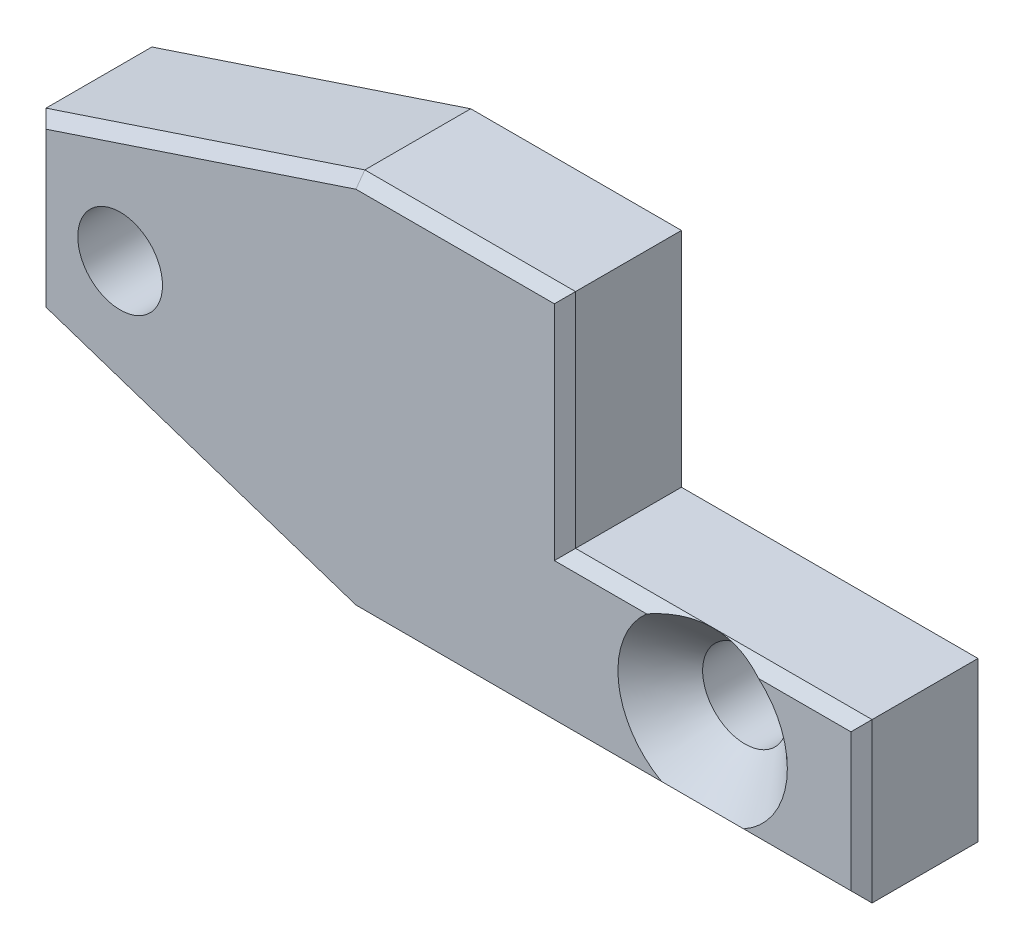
ISO-10303-21;
HEADER;
FILE_DESCRIPTION(('STEP AP214'),'2;1');
FILE_NAME('part.step','',(''),(''),'','','');
FILE_SCHEMA(('AUTOMOTIVE_DESIGN { 1 0 10303 214 1 1 1 1 }'));
ENDSEC;
DATA;
#1=APPLICATION_CONTEXT('core data for automotive mechanical design processes');
#2=APPLICATION_PROTOCOL_DEFINITION('international standard','automotive_design',2000,#1);
#3=PRODUCT_CONTEXT('',#1,'mechanical');
#4=PRODUCT('Part','Part','',(#3));
#5=PRODUCT_RELATED_PRODUCT_CATEGORY('part','',(#4));
#6=PRODUCT_DEFINITION_FORMATION('','',#4);
#7=PRODUCT_DEFINITION_CONTEXT('part definition',#1,'design');
#8=PRODUCT_DEFINITION('design','',#6,#7);
#9=PRODUCT_DEFINITION_SHAPE('','',#8);
#10=(LENGTH_UNIT() NAMED_UNIT(*) SI_UNIT(.MILLI.,.METRE.));
#11=(NAMED_UNIT(*) PLANE_ANGLE_UNIT() SI_UNIT($,.RADIAN.));
#12=(NAMED_UNIT(*) SI_UNIT($,.STERADIAN.) SOLID_ANGLE_UNIT());
#13=UNCERTAINTY_MEASURE_WITH_UNIT(LENGTH_MEASURE(1.E-05),#10,'distance_accuracy_value','');
#14=(GEOMETRIC_REPRESENTATION_CONTEXT(3) GLOBAL_UNCERTAINTY_ASSIGNED_CONTEXT((#13)) GLOBAL_UNIT_ASSIGNED_CONTEXT((#10,
#11,#12)) REPRESENTATION_CONTEXT('',''));
#15=CARTESIAN_POINT('',(0.,0.,0.));
#16=DIRECTION('',(0.,0.,1.));
#17=DIRECTION('',(1.,0.,0.));
#18=AXIS2_PLACEMENT_3D('',#15,#16,#17);
#19=CARTESIAN_POINT('',(0.,0.,5.49999999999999));
#20=DIRECTION('',(0.,-0.707106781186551,-0.707106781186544));
#21=DIRECTION('',(0.,0.707106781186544,-0.707106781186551));
#22=AXIS2_PLACEMENT_3D('',#19,#20,#21);
#23=PLANE('',#22);
#24=DIRECTION('',(-1.,0.,0.));
#25=VECTOR('',#24,1.);
#26=CARTESIAN_POINT('',(-25.,-0.500000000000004,6.));
#27=LINE('',#26,#25);
#28=CARTESIAN_POINT('',(3.8542486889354,-0.500000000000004,6.));
#29=VERTEX_POINT('',#28);
#30=CARTESIAN_POINT('',(-0.500000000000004,-0.500000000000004,6.));
#31=VERTEX_POINT('',#30);
#32=EDGE_CURVE('E263',#29,#31,#27,.T.);
#33=ORIENTED_EDGE('',*,*,#32,.F.);
#34=CARTESIAN_POINT('',(3.8542486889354,-0.500000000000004,6.));
#35=CARTESIAN_POINT('',(4.01258641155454,-0.440132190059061,5.94013219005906));
#36=CARTESIAN_POINT('',(4.17423871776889,-0.384426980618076,5.88442698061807));
#37=CARTESIAN_POINT('',(4.50389329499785,-0.282663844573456,5.78266384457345));
#38=CARTESIAN_POINT('',(4.6719083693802,-0.236626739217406,5.7366267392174));
#39=CARTESIAN_POINT('',(5.01238331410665,-0.15601328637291,5.6560132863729));
#40=CARTESIAN_POINT('',(5.18481341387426,-0.121374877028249,5.62137487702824));
#41=CARTESIAN_POINT('',(5.53361721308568,-0.0645379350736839,5.56453793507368));
#42=CARTESIAN_POINT('',(5.70998746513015,-0.0423289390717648,5.54232893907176));
#43=CARTESIAN_POINT('',(6.05237188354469,-0.0123708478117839,5.51237084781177));
#44=CARTESIAN_POINT('',(6.21822452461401,-0.00370115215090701,5.5037011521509));
#45=CARTESIAN_POINT('',(6.55036088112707,0.00178855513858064,5.49821144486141));
#46=CARTESIAN_POINT('',(6.71664467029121,-0.0013936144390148,5.50139361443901));
#47=CARTESIAN_POINT('',(7.0478905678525,-0.0194818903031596,5.51948189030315));
#48=CARTESIAN_POINT('',(7.21285285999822,-0.0343863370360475,5.53438633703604));
#49=CARTESIAN_POINT('',(7.53994163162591,-0.0753382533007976,5.57533825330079));
#50=CARTESIAN_POINT('',(7.70206865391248,-0.101383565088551,5.60138356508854));
#51=CARTESIAN_POINT('',(7.97376364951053,-0.154250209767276,5.65425020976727));
#52=CARTESIAN_POINT('',(8.0843760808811,-0.178446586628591,5.67844658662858));
#53=CARTESIAN_POINT('',(8.30341082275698,-0.231449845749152,5.73144984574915));
#54=CARTESIAN_POINT('',(8.41183240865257,-0.260258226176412,5.76025822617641));
#55=CARTESIAN_POINT('',(8.62603403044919,-0.322040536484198,5.82204053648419));
#56=CARTESIAN_POINT('',(8.73181845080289,-0.355006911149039,5.85500691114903));
#57=CARTESIAN_POINT('',(8.9407608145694,-0.424742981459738,5.92474298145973));
#58=CARTESIAN_POINT('',(9.0439205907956,-0.461509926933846,5.96150992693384));
#59=CARTESIAN_POINT('',(9.1457513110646,-0.500000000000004,6.));
#60=B_SPLINE_CURVE_WITH_KNOTS('',3,(#34,#35,#36,#37,#38,#39,#40,#41,#42,#43,#44,#45,#46,#47,#48,
#49,#50,#51,#52,#53,#54,#55,#56,#57,#58,#59),.UNSPECIFIED.,.F.,.F.,(4,2,2,2,2,2,2,2,2,2,2,2,4),
(0.,0.538753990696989,1.07865660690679,1.61556903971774,2.15202880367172,2.65011954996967,
3.14830196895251,3.64641387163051,4.144429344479,4.49158740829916,4.83885847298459,
5.18550738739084,5.53190719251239),.UNSPECIFIED.);
#61=CARTESIAN_POINT('',(6.5,0.,5.49999999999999));
#62=VERTEX_POINT('',#61);
#63=EDGE_CURVE('E11',#29,#62,#60,.T.);
#64=ORIENTED_EDGE('',*,*,#63,.T.);
#65=DIRECTION('',(1.,0.,0.));
#66=VECTOR('',#65,1.);
#67=CARTESIAN_POINT('',(0.,0.,5.49999999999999));
#68=LINE('',#67,#66);
#69=CARTESIAN_POINT('',(0.,0.,5.49999999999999));
#70=VERTEX_POINT('',#69);
#71=EDGE_CURVE('E236',#70,#62,#68,.T.);
#72=ORIENTED_EDGE('',*,*,#71,.F.);
#73=DIRECTION('',(-0.577350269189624,-0.577350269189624,0.57735026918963));
#74=VECTOR('',#73,1.);
#75=CARTESIAN_POINT('',(3.49999999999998,3.49999999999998,1.99999999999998));
#76=LINE('',#75,#74);
#77=EDGE_CURVE('E333',#31,#70,#76,.F.);
#78=ORIENTED_EDGE('',*,*,#77,.F.);
#79=EDGE_LOOP('',(#33,#64,#72,#78));
#80=FACE_BOUND('',#79,.T.);
#81=ADVANCED_FACE('F29',(#80),#23,.F.);
#82=CARTESIAN_POINT('',(-25.,10.5,6.));
#83=DIRECTION('',(0.,0.,1.));
#84=DIRECTION('',(1.,0.,0.));
#85=AXIS2_PLACEMENT_3D('',#82,#83,#84);
#86=PLANE('',#85);
#87=CARTESIAN_POINT('',(13.5,-0.500000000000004,6.));
#88=VERTEX_POINT('',#87);
#89=CARTESIAN_POINT('',(9.1457513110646,-0.500000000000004,6.));
#90=VERTEX_POINT('',#89);
#91=EDGE_CURVE('E264',#88,#90,#27,.T.);
#92=ORIENTED_EDGE('',*,*,#91,.T.);
#93=CARTESIAN_POINT('',(6.5,-3.50000000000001,6.));
#94=DIRECTION('',(0.,0.,1.));
#95=DIRECTION('',(1.,0.,0.));
#96=AXIS2_PLACEMENT_3D('',#93,#94,#95);
#97=CIRCLE('',#96,4.00000000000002);
#98=CARTESIAN_POINT('',(8.43649167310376,-7.,6.));
#99=VERTEX_POINT('',#98);
#100=EDGE_CURVE('E275',#90,#99,#97,.F.);
#101=ORIENTED_EDGE('',*,*,#100,.T.);
#102=DIRECTION('',(1.,0.,0.));
#103=VECTOR('',#102,1.);
#104=CARTESIAN_POINT('',(14.,-6.99999999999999,6.));
#105=LINE('',#104,#103);
#106=CARTESIAN_POINT('',(13.5,-6.99999999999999,6.));
#107=VERTEX_POINT('',#106);
#108=EDGE_CURVE('E257',#99,#107,#105,.T.);
#109=ORIENTED_EDGE('',*,*,#108,.T.);
#110=DIRECTION('',(0.,1.,0.));
#111=VECTOR('',#110,1.);
#112=CARTESIAN_POINT('',(13.5,10.5,6.));
#113=LINE('',#112,#111);
#114=EDGE_CURVE('E261',#107,#88,#113,.T.);
#115=ORIENTED_EDGE('',*,*,#114,.T.);
#116=EDGE_LOOP('',(#92,#101,#109,#115));
#117=FACE_BOUND('',#116,.T.);
#118=ADVANCED_FACE('F324',(#117),#86,.T.);
#119=CARTESIAN_POINT('',(0.,10.5,6.));
#120=DIRECTION('',(0.,-1.,0.));
#121=DIRECTION('',(0.,0.,-1.));
#122=AXIS2_PLACEMENT_3D('',#119,#120,#121);
#123=PLANE('',#122);
#124=DIRECTION('',(0.,0.,-1.));
#125=VECTOR('',#124,1.);
#126=CARTESIAN_POINT('',(0.,10.5,6.));
#127=LINE('',#126,#125);
#128=CARTESIAN_POINT('',(0.,10.5,5.5));
#129=VERTEX_POINT('',#128);
#130=CARTESIAN_POINT('',(0.,10.5,0.500000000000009));
#131=VERTEX_POINT('',#130);
#132=EDGE_CURVE('E380',#129,#131,#127,.T.);
#133=ORIENTED_EDGE('',*,*,#132,.T.);
#134=DIRECTION('',(-1.,0.,0.));
#135=VECTOR('',#134,1.);
#136=CARTESIAN_POINT('',(0.,10.5,0.500000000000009));
#137=LINE('',#136,#135);
#138=CARTESIAN_POINT('',(-9.94877148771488,10.5,0.500000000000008));
#139=VERTEX_POINT('',#138);
#140=EDGE_CURVE('E248',#131,#139,#137,.T.);
#141=ORIENTED_EDGE('',*,*,#140,.T.);
#142=DIRECTION('',(0.,0.,-1.));
#143=VECTOR('',#142,1.);
#144=CARTESIAN_POINT('',(-9.94877148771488,10.5,6.));
#145=LINE('',#144,#143);
#146=CARTESIAN_POINT('',(-9.94877148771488,10.5,5.5));
#147=VERTEX_POINT('',#146);
#148=EDGE_CURVE('E185',#147,#139,#145,.T.);
#149=ORIENTED_EDGE('',*,*,#148,.F.);
#150=DIRECTION('',(1.,0.,0.));
#151=VECTOR('',#150,1.);
#152=CARTESIAN_POINT('',(0.,10.5,5.5));
#153=LINE('',#152,#151);
#154=EDGE_CURVE('E246',#147,#129,#153,.T.);
#155=ORIENTED_EDGE('',*,*,#154,.T.);
#156=EDGE_LOOP('',(#133,#141,#149,#155));
#157=FACE_BOUND('',#156,.T.);
#158=ADVANCED_FACE('F328',(#157),#123,.F.);
#159=CARTESIAN_POINT('',(-9.94877148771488,10.5,6.));
#160=DIRECTION('',(0.315258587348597,-0.949005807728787,0.));
#161=DIRECTION('',(0.949005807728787,0.315258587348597,0.));
#162=AXIS2_PLACEMENT_3D('',#159,#160,#161);
#163=PLANE('',#162);
#164=ORIENTED_EDGE('',*,*,#148,.T.);
#165=DIRECTION('',(-0.949005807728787,-0.315258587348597,0.));
#166=VECTOR('',#165,1.);
#167=CARTESIAN_POINT('',(-9.94877148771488,10.5,0.500000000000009));
#168=LINE('',#167,#166);
#169=CARTESIAN_POINT('',(-25.,5.5,0.500000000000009));
#170=VERTEX_POINT('',#169);
#171=EDGE_CURVE('E184',#139,#170,#168,.T.);
#172=ORIENTED_EDGE('',*,*,#171,.T.);
#173=DIRECTION('',(0.,0.,-1.));
#174=VECTOR('',#173,1.);
#175=CARTESIAN_POINT('',(-25.,5.5,6.));
#176=LINE('',#175,#174);
#177=CARTESIAN_POINT('',(-25.,5.5,5.5));
#178=VERTEX_POINT('',#177);
#179=EDGE_CURVE('E167',#178,#170,#176,.T.);
#180=ORIENTED_EDGE('',*,*,#179,.F.);
#181=DIRECTION('',(0.949005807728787,0.315258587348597,0.));
#182=VECTOR('',#181,1.);
#183=CARTESIAN_POINT('',(-9.94877148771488,10.5,5.5));
#184=LINE('',#183,#182);
#185=EDGE_CURVE('E181',#178,#147,#184,.T.);
#186=ORIENTED_EDGE('',*,*,#185,.T.);
#187=EDGE_LOOP('',(#164,#172,#180,#186));
#188=FACE_BOUND('',#187,.T.);
#189=ADVANCED_FACE('F31',(#188),#163,.F.);
#190=CARTESIAN_POINT('',(-25.,5.5,6.));
#191=DIRECTION('',(1.,0.,0.));
#192=DIRECTION('',(0.,0.,-1.));
#193=AXIS2_PLACEMENT_3D('',#190,#191,#192);
#194=PLANE('',#193);
#195=ORIENTED_EDGE('',*,*,#179,.T.);
#196=DIRECTION('',(0.,-1.,0.));
#197=VECTOR('',#196,1.);
#198=CARTESIAN_POINT('',(-25.,5.5,0.500000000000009));
#199=LINE('',#198,#197);
#200=CARTESIAN_POINT('',(-25.,-2.5,0.500000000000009));
#201=VERTEX_POINT('',#200);
#202=EDGE_CURVE('E174',#170,#201,#199,.T.);
#203=ORIENTED_EDGE('',*,*,#202,.T.);
#204=DIRECTION('',(0.,0.,-1.));
#205=VECTOR('',#204,1.);
#206=CARTESIAN_POINT('',(-25.,-2.5,6.));
#207=LINE('',#206,#205);
#208=CARTESIAN_POINT('',(-25.,-2.5,5.5));
#209=VERTEX_POINT('',#208);
#210=EDGE_CURVE('E169',#209,#201,#207,.T.);
#211=ORIENTED_EDGE('',*,*,#210,.F.);
#212=DIRECTION('',(0.,1.,0.));
#213=VECTOR('',#212,1.);
#214=CARTESIAN_POINT('',(-25.,5.5,5.5));
#215=LINE('',#214,#213);
#216=EDGE_CURVE('E164',#209,#178,#215,.T.);
#217=ORIENTED_EDGE('',*,*,#216,.T.);
#218=EDGE_LOOP('',(#195,#203,#211,#217));
#219=FACE_BOUND('',#218,.T.);
#220=ADVANCED_FACE('F166',(#219),#194,.F.);
#221=CARTESIAN_POINT('',(-25.,-2.5,6.));
#222=DIRECTION('',(0.315258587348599,0.949005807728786,0.));
#223=DIRECTION('',(-0.949005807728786,0.315258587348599,0.));
#224=AXIS2_PLACEMENT_3D('',#221,#222,#223);
#225=PLANE('',#224);
#226=ORIENTED_EDGE('',*,*,#210,.T.);
#227=DIRECTION('',(0.949005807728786,-0.315258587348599,0.));
#228=VECTOR('',#227,1.);
#229=CARTESIAN_POINT('',(-25.,-2.5,0.500000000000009));
#230=LINE('',#229,#228);
#231=CARTESIAN_POINT('',(-9.94877148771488,-7.50000000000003,0.500000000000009));
#232=VERTEX_POINT('',#231);
#233=EDGE_CURVE('E225',#201,#232,#230,.T.);
#234=ORIENTED_EDGE('',*,*,#233,.T.);
#235=DIRECTION('',(0.,0.,-1.));
#236=VECTOR('',#235,1.);
#237=CARTESIAN_POINT('',(-9.94877148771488,-7.50000000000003,6.));
#238=LINE('',#237,#236);
#239=CARTESIAN_POINT('',(-9.94877148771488,-7.50000000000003,5.5));
#240=VERTEX_POINT('',#239);
#241=EDGE_CURVE('E392',#240,#232,#238,.T.);
#242=ORIENTED_EDGE('',*,*,#241,.F.);
#243=DIRECTION('',(-0.949005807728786,0.315258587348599,0.));
#244=VECTOR('',#243,1.);
#245=CARTESIAN_POINT('',(-25.,-2.5,5.5));
#246=LINE('',#245,#244);
#247=EDGE_CURVE('E223',#240,#209,#246,.T.);
#248=ORIENTED_EDGE('',*,*,#247,.T.);
#249=EDGE_LOOP('',(#226,#234,#242,#248));
#250=FACE_BOUND('',#249,.T.);
#251=ADVANCED_FACE('F397',(#250),#225,.F.);
#252=CARTESIAN_POINT('',(-9.94877148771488,-7.50000000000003,6.));
#253=DIRECTION('',(0.,1.,0.));
#254=DIRECTION('',(-1.,0.,0.));
#255=AXIS2_PLACEMENT_3D('',#252,#253,#254);
#256=PLANE('',#255);
#257=ORIENTED_EDGE('',*,*,#241,.T.);
#258=DIRECTION('',(1.,0.,0.));
#259=VECTOR('',#258,1.);
#260=CARTESIAN_POINT('',(-9.94877148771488,-7.50000000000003,0.500000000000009));
#261=LINE('',#260,#259);
#262=CARTESIAN_POINT('',(14.,-7.5,0.500000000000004));
#263=VERTEX_POINT('',#262);
#264=EDGE_CURVE('E229',#232,#263,#261,.T.);
#265=ORIENTED_EDGE('',*,*,#264,.T.);
#266=DIRECTION('',(0.,0.,-1.));
#267=VECTOR('',#266,1.);
#268=CARTESIAN_POINT('',(14.,-7.5,6.));
#269=LINE('',#268,#267);
#270=CARTESIAN_POINT('',(14.,-7.5,5.5));
#271=VERTEX_POINT('',#270);
#272=EDGE_CURVE('E389',#271,#263,#269,.T.);
#273=ORIENTED_EDGE('',*,*,#272,.F.);
#274=DIRECTION('',(-1.,0.,0.));
#275=VECTOR('',#274,1.);
#276=CARTESIAN_POINT('',(-9.94877148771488,-7.50000000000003,5.5));
#277=LINE('',#276,#275);
#278=EDGE_CURVE('E227',#271,#240,#277,.T.);
#279=ORIENTED_EDGE('',*,*,#278,.T.);
#280=EDGE_LOOP('',(#257,#265,#273,#279));
#281=FACE_BOUND('',#280,.T.);
#282=ADVANCED_FACE('F442',(#281),#256,.F.);
#283=CARTESIAN_POINT('',(14.,0.,6.));
#284=DIRECTION('',(1.,0.,0.));
#285=DIRECTION('',(0.,1.,0.));
#286=AXIS2_PLACEMENT_3D('',#283,#284,#285);
#287=PLANE('',#286);
#288=ORIENTED_EDGE('',*,*,#272,.T.);
#289=DIRECTION('',(0.,1.,0.));
#290=VECTOR('',#289,1.);
#291=CARTESIAN_POINT('',(14.,0.,0.500000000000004));
#292=LINE('',#291,#290);
#293=CARTESIAN_POINT('',(14.,0.,0.500000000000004));
#294=VERTEX_POINT('',#293);
#295=EDGE_CURVE('E233',#263,#294,#292,.T.);
#296=ORIENTED_EDGE('',*,*,#295,.T.);
#297=DIRECTION('',(0.,0.,-1.));
#298=VECTOR('',#297,1.);
#299=CARTESIAN_POINT('',(14.,0.,6.));
#300=LINE('',#299,#298);
#301=CARTESIAN_POINT('',(14.,0.,5.49999999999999));
#302=VERTEX_POINT('',#301);
#303=EDGE_CURVE('E386',#302,#294,#300,.T.);
#304=ORIENTED_EDGE('',*,*,#303,.F.);
#305=DIRECTION('',(0.,-1.,0.));
#306=VECTOR('',#305,1.);
#307=CARTESIAN_POINT('',(14.,0.,5.49999999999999));
#308=LINE('',#307,#306);
#309=EDGE_CURVE('E231',#302,#271,#308,.T.);
#310=ORIENTED_EDGE('',*,*,#309,.T.);
#311=EDGE_LOOP('',(#288,#296,#304,#310));
#312=FACE_BOUND('',#311,.T.);
#313=ADVANCED_FACE('F445',(#312),#287,.T.);
#314=CARTESIAN_POINT('',(0.,0.,6.));
#315=DIRECTION('',(0.,1.,0.));
#316=DIRECTION('',(0.,0.,1.));
#317=AXIS2_PLACEMENT_3D('',#314,#315,#316);
#318=PLANE('',#317);
#319=ORIENTED_EDGE('',*,*,#303,.T.);
#320=DIRECTION('',(-1.,0.,0.));
#321=VECTOR('',#320,1.);
#322=CARTESIAN_POINT('',(0.,0.,0.500000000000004));
#323=LINE('',#322,#321);
#324=CARTESIAN_POINT('',(0.,0.,0.500000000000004));
#325=VERTEX_POINT('',#324);
#326=EDGE_CURVE('E239',#294,#325,#323,.T.);
#327=ORIENTED_EDGE('',*,*,#326,.T.);
#328=DIRECTION('',(0.,0.,-1.));
#329=VECTOR('',#328,1.);
#330=CARTESIAN_POINT('',(0.,0.,6.));
#331=LINE('',#330,#329);
#332=EDGE_CURVE('E383',#70,#325,#331,.T.);
#333=ORIENTED_EDGE('',*,*,#332,.F.);
#334=ORIENTED_EDGE('',*,*,#71,.T.);
#335=EDGE_CURVE('E235',#62,#302,#68,.T.);
#336=ORIENTED_EDGE('',*,*,#335,.T.);
#337=EDGE_LOOP('',(#319,#327,#333,#334,#336));
#338=FACE_BOUND('',#337,.T.);
#339=ADVANCED_FACE('F448',(#338),#318,.T.);
#340=CARTESIAN_POINT('',(0.,10.5,6.));
#341=DIRECTION('',(1.,0.,0.));
#342=DIRECTION('',(0.,1.,0.));
#343=AXIS2_PLACEMENT_3D('',#340,#341,#342);
#344=PLANE('',#343);
#345=ORIENTED_EDGE('',*,*,#332,.T.);
#346=DIRECTION('',(0.,1.,0.));
#347=VECTOR('',#346,1.);
#348=CARTESIAN_POINT('',(0.,10.5,0.500000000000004));
#349=LINE('',#348,#347);
#350=EDGE_CURVE('E244',#325,#131,#349,.T.);
#351=ORIENTED_EDGE('',*,*,#350,.T.);
#352=ORIENTED_EDGE('',*,*,#132,.F.);
#353=DIRECTION('',(0.,-1.,0.));
#354=VECTOR('',#353,1.);
#355=CARTESIAN_POINT('',(0.,10.5,5.49999999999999));
#356=LINE('',#355,#354);
#357=EDGE_CURVE('E241',#129,#70,#356,.T.);
#358=ORIENTED_EDGE('',*,*,#357,.T.);
#359=EDGE_LOOP('',(#345,#351,#352,#358));
#360=FACE_BOUND('',#359,.T.);
#361=ADVANCED_FACE('F453',(#360),#344,.T.);
#362=CARTESIAN_POINT('',(-21.,1.49999999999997,6.));
#363=DIRECTION('',(0.,0.,1.));
#364=DIRECTION('',(1.,0.,0.));
#365=AXIS2_PLACEMENT_3D('',#362,#363,#364);
#366=CIRCLE('',#365,2.);
#367=CARTESIAN_POINT('',(-19.,1.49999999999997,6.));
#368=VERTEX_POINT('',#367);
#369=EDGE_CURVE('E458',#368,#368,#366,.T.);
#370=ORIENTED_EDGE('',*,*,#369,.F.);
#371=EDGE_LOOP('',(#370));
#372=FACE_BOUND('',#371,.T.);
#373=CARTESIAN_POINT('',(-9.86789471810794,-7.00000000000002,6.));
#374=VERTEX_POINT('',#373);
#375=CARTESIAN_POINT('',(4.56350832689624,-7.,6.));
#376=VERTEX_POINT('',#375);
#377=EDGE_CURVE('E258',#374,#376,#105,.T.);
#378=ORIENTED_EDGE('',*,*,#377,.T.);
#379=CARTESIAN_POINT('',(6.5,-3.50000000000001,6.));
#380=DIRECTION('',(0.,0.,1.));
#381=DIRECTION('',(1.,0.,0.));
#382=AXIS2_PLACEMENT_3D('',#379,#380,#381);
#383=CIRCLE('',#382,4.00000000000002);
#384=EDGE_CURVE('E273',#376,#29,#383,.F.);
#385=ORIENTED_EDGE('',*,*,#384,.T.);
#386=ORIENTED_EDGE('',*,*,#32,.T.);
#387=DIRECTION('',(0.,1.,0.));
#388=VECTOR('',#387,1.);
#389=CARTESIAN_POINT('',(-0.500000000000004,10.5,6.));
#390=LINE('',#389,#388);
#391=CARTESIAN_POINT('',(-0.500000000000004,9.99999999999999,6.));
#392=VERTEX_POINT('',#391);
#393=EDGE_CURVE('E267',#31,#392,#390,.T.);
#394=ORIENTED_EDGE('',*,*,#393,.T.);
#395=DIRECTION('',(-1.,0.,0.));
#396=VECTOR('',#395,1.);
#397=CARTESIAN_POINT('',(-9.94877148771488,9.99999999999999,6.));
#398=LINE('',#397,#396);
#399=CARTESIAN_POINT('',(-9.86789471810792,9.99999999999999,6.));
#400=VERTEX_POINT('',#399);
#401=EDGE_CURVE('E250',#392,#400,#398,.T.);
#402=ORIENTED_EDGE('',*,*,#401,.T.);
#403=DIRECTION('',(-0.949005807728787,-0.315258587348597,0.));
#404=VECTOR('',#403,1.);
#405=CARTESIAN_POINT('',(-24.8423707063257,5.0254970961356,6.));
#406=LINE('',#405,#404);
#407=CARTESIAN_POINT('',(-24.5,5.13923223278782,6.));
#408=VERTEX_POINT('',#407);
#409=EDGE_CURVE('E252',#400,#408,#406,.T.);
#410=ORIENTED_EDGE('',*,*,#409,.T.);
#411=DIRECTION('',(0.,-1.,0.));
#412=VECTOR('',#411,1.);
#413=CARTESIAN_POINT('',(-24.5,-2.5,6.));
#414=LINE('',#413,#412);
#415=CARTESIAN_POINT('',(-24.5,-2.13923223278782,6.));
#416=VERTEX_POINT('',#415);
#417=EDGE_CURVE('E191',#408,#416,#414,.T.);
#418=ORIENTED_EDGE('',*,*,#417,.T.);
#419=DIRECTION('',(0.949005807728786,-0.315258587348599,0.));
#420=VECTOR('',#419,1.);
#421=CARTESIAN_POINT('',(-9.79114219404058,-7.02549709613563,6.));
#422=LINE('',#421,#420);
#423=EDGE_CURVE('E255',#416,#374,#422,.T.);
#424=ORIENTED_EDGE('',*,*,#423,.T.);
#425=EDGE_LOOP('',(#378,#385,#386,#394,#402,#410,#418,#424));
#426=FACE_BOUND('',#425,.T.);
#427=ADVANCED_FACE('F331',(#372,#426),#86,.T.);
#428=CARTESIAN_POINT('',(-25.,10.5,0.));
#429=DIRECTION('',(0.,0.,1.));
#430=DIRECTION('',(1.,0.,0.));
#431=AXIS2_PLACEMENT_3D('',#428,#429,#430);
#432=PLANE('',#431);
#433=CARTESIAN_POINT('',(6.5,-3.50000000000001,0.));
#434=DIRECTION('',(0.,0.,1.));
#435=DIRECTION('',(1.,0.,0.));
#436=AXIS2_PLACEMENT_3D('',#433,#434,#435);
#437=CIRCLE('',#436,2.);
#438=CARTESIAN_POINT('',(8.5,-3.50000000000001,0.));
#439=VERTEX_POINT('',#438);
#440=EDGE_CURVE('E463',#439,#439,#437,.T.);
#441=ORIENTED_EDGE('',*,*,#440,.T.);
#442=EDGE_LOOP('',(#441));
#443=FACE_BOUND('',#442,.T.);
#444=CARTESIAN_POINT('',(-21.,1.49999999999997,0.));
#445=DIRECTION('',(0.,0.,1.));
#446=DIRECTION('',(1.,0.,0.));
#447=AXIS2_PLACEMENT_3D('',#444,#445,#446);
#448=CIRCLE('',#447,2.);
#449=CARTESIAN_POINT('',(-19.,1.49999999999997,0.));
#450=VERTEX_POINT('',#449);
#451=EDGE_CURVE('E456',#450,#450,#448,.T.);
#452=ORIENTED_EDGE('',*,*,#451,.T.);
#453=EDGE_LOOP('',(#452));
#454=FACE_BOUND('',#453,.T.);
#455=DIRECTION('',(0.,1.,0.));
#456=VECTOR('',#455,1.);
#457=CARTESIAN_POINT('',(-24.5,10.5,0.));
#458=LINE('',#457,#456);
#459=CARTESIAN_POINT('',(-24.5,-2.13923223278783,0.));
#460=VERTEX_POINT('',#459);
#461=CARTESIAN_POINT('',(-24.5,5.13923223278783,0.));
#462=VERTEX_POINT('',#461);
#463=EDGE_CURVE('E218',#460,#462,#458,.T.);
#464=ORIENTED_EDGE('',*,*,#463,.T.);
#465=DIRECTION('',(0.949005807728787,0.315258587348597,0.));
#466=VECTOR('',#465,1.);
#467=CARTESIAN_POINT('',(-23.3464595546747,5.52243698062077,0.));
#468=LINE('',#467,#466);
#469=CARTESIAN_POINT('',(-9.86789471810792,10.,0.));
#470=VERTEX_POINT('',#469);
#471=EDGE_CURVE('E175',#462,#470,#468,.T.);
#472=ORIENTED_EDGE('',*,*,#471,.T.);
#473=DIRECTION('',(1.,0.,0.));
#474=VECTOR('',#473,1.);
#475=CARTESIAN_POINT('',(-25.,10.,0.));
#476=LINE('',#475,#474);
#477=CARTESIAN_POINT('',(-0.500000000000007,10.,0.));
#478=VERTEX_POINT('',#477);
#479=EDGE_CURVE('E203',#470,#478,#476,.T.);
#480=ORIENTED_EDGE('',*,*,#479,.T.);
#481=DIRECTION('',(0.,-1.,0.));
#482=VECTOR('',#481,1.);
#483=CARTESIAN_POINT('',(-0.500000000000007,0.,0.));
#484=LINE('',#483,#482);
#485=CARTESIAN_POINT('',(-0.500000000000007,-0.500000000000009,0.));
#486=VERTEX_POINT('',#485);
#487=EDGE_CURVE('E208',#478,#486,#484,.T.);
#488=ORIENTED_EDGE('',*,*,#487,.T.);
#489=DIRECTION('',(1.,0.,0.));
#490=VECTOR('',#489,1.);
#491=CARTESIAN_POINT('',(14.,-0.500000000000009,0.));
#492=LINE('',#491,#490);
#493=CARTESIAN_POINT('',(13.5,-0.500000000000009,0.));
#494=VERTEX_POINT('',#493);
#495=EDGE_CURVE('E210',#486,#494,#492,.T.);
#496=ORIENTED_EDGE('',*,*,#495,.T.);
#497=DIRECTION('',(0.,-1.,0.));
#498=VECTOR('',#497,1.);
#499=CARTESIAN_POINT('',(13.5,-7.5,0.));
#500=LINE('',#499,#498);
#501=CARTESIAN_POINT('',(13.5,-7.,0.));
#502=VERTEX_POINT('',#501);
#503=EDGE_CURVE('E212',#494,#502,#500,.T.);
#504=ORIENTED_EDGE('',*,*,#503,.T.);
#505=DIRECTION('',(-1.,0.,0.));
#506=VECTOR('',#505,1.);
#507=CARTESIAN_POINT('',(-25.,-7.00000000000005,0.));
#508=LINE('',#507,#506);
#509=CARTESIAN_POINT('',(-9.86789471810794,-7.00000000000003,0.));
#510=VERTEX_POINT('',#509);
#511=EDGE_CURVE('E214',#502,#510,#508,.T.);
#512=ORIENTED_EDGE('',*,*,#511,.T.);
#513=DIRECTION('',(-0.949005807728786,0.315258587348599,0.));
#514=VECTOR('',#513,1.);
#515=CARTESIAN_POINT('',(-28.7317397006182,-0.733453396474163,0.));
#516=LINE('',#515,#514);
#517=EDGE_CURVE('E216',#510,#460,#516,.T.);
#518=ORIENTED_EDGE('',*,*,#517,.T.);
#519=EDGE_LOOP('',(#464,#472,#480,#488,#496,#504,#512,#518));
#520=FACE_BOUND('',#519,.T.);
#521=ADVANCED_FACE('F412',(#443,#454,#520),#432,.F.);
#522=CARTESIAN_POINT('',(13.5,10.5,0.));
#523=DIRECTION('',(0.707106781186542,0.,-0.707106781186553));
#524=DIRECTION('',(-0.707106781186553,0.,-0.707106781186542));
#525=AXIS2_PLACEMENT_3D('',#522,#523,#524);
#526=PLANE('',#525);
#527=DIRECTION('',(0.577350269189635,-0.577350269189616,0.577350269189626));
#528=VECTOR('',#527,1.);
#529=CARTESIAN_POINT('',(7.66666666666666,-1.16666666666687,-5.83333333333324));
#530=LINE('',#529,#528);
#531=EDGE_CURVE('E374',#502,#263,#530,.T.);
#532=ORIENTED_EDGE('',*,*,#531,.F.);
#533=ORIENTED_EDGE('',*,*,#503,.F.);
#534=DIRECTION('',(-0.57735026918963,-0.577350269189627,-0.577350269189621));
#535=VECTOR('',#534,1.);
#536=CARTESIAN_POINT('',(0.666666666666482,-13.3333333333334,-12.8333333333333));
#537=LINE('',#536,#535);
#538=EDGE_CURVE('E377',#294,#494,#537,.T.);
#539=ORIENTED_EDGE('',*,*,#538,.F.);
#540=ORIENTED_EDGE('',*,*,#295,.F.);
#541=EDGE_LOOP('',(#532,#533,#539,#540));
#542=FACE_BOUND('',#541,.T.);
#543=ADVANCED_FACE('F434',(#542),#526,.T.);
#544=CARTESIAN_POINT('',(-25.,-0.500000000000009,0.));
#545=DIRECTION('',(0.,0.707106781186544,-0.707106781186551));
#546=DIRECTION('',(0.,0.707106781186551,0.707106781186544));
#547=AXIS2_PLACEMENT_3D('',#544,#545,#546);
#548=PLANE('',#547);
#549=ORIENTED_EDGE('',*,*,#538,.T.);
#550=ORIENTED_EDGE('',*,*,#495,.F.);
#551=DIRECTION('',(-0.577350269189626,-0.577350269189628,-0.577350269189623));
#552=VECTOR('',#551,1.);
#553=CARTESIAN_POINT('',(-8.66666666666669,-8.66666666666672,-8.16666666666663));
#554=LINE('',#553,#552);
#555=EDGE_CURVE('E371',#325,#486,#554,.T.);
#556=ORIENTED_EDGE('',*,*,#555,.F.);
#557=ORIENTED_EDGE('',*,*,#326,.F.);
#558=EDGE_LOOP('',(#549,#550,#556,#557));
#559=FACE_BOUND('',#558,.T.);
#560=ADVANCED_FACE('F429',(#559),#548,.T.);
#561=CARTESIAN_POINT('',(-9.94877148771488,-7.50000000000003,0.500000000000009));
#562=DIRECTION('',(0.,0.707106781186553,0.707106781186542));
#563=DIRECTION('',(0.,-0.707106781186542,0.707106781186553));
#564=AXIS2_PLACEMENT_3D('',#561,#562,#563);
#565=PLANE('',#564);
#566=ORIENTED_EDGE('',*,*,#531,.T.);
#567=ORIENTED_EDGE('',*,*,#264,.F.);
#568=DIRECTION('',(0.113636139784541,0.702526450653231,-0.702526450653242));
#569=VECTOR('',#568,1.);
#570=CARTESIAN_POINT('',(-9.94877148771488,-7.50000000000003,0.500000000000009));
#571=LINE('',#570,#569);
#572=EDGE_CURVE('E368',#510,#232,#571,.F.);
#573=ORIENTED_EDGE('',*,*,#572,.F.);
#574=ORIENTED_EDGE('',*,*,#511,.F.);
#575=EDGE_LOOP('',(#566,#567,#573,#574));
#576=FACE_BOUND('',#575,.T.);
#577=ADVANCED_FACE('F439',(#576),#565,.F.);
#578=CARTESIAN_POINT('',(-0.500000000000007,10.5,0.));
#579=DIRECTION('',(0.707106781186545,0.,-0.70710678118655));
#580=DIRECTION('',(-0.70710678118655,0.,-0.707106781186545));
#581=AXIS2_PLACEMENT_3D('',#578,#579,#580);
#582=PLANE('',#581);
#583=ORIENTED_EDGE('',*,*,#555,.T.);
#584=ORIENTED_EDGE('',*,*,#487,.F.);
#585=DIRECTION('',(0.57735026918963,0.57735026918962,0.577350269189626));
#586=VECTOR('',#585,1.);
#587=CARTESIAN_POINT('',(0.,10.5,0.500000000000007));
#588=LINE('',#587,#586);
#589=EDGE_CURVE('E365',#131,#478,#588,.F.);
#590=ORIENTED_EDGE('',*,*,#589,.F.);
#591=ORIENTED_EDGE('',*,*,#350,.F.);
#592=EDGE_LOOP('',(#583,#584,#590,#591));
#593=FACE_BOUND('',#592,.T.);
#594=ADVANCED_FACE('F424',(#593),#582,.T.);
#595=CARTESIAN_POINT('',(-25.,-2.5,0.500000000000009));
#596=DIRECTION('',(0.222921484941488,0.671048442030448,0.707106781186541));
#597=DIRECTION('',(0.,-0.725359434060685,0.688370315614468));
#598=AXIS2_PLACEMENT_3D('',#595,#596,#597);
#599=PLANE('',#598);
#600=ORIENTED_EDGE('',*,*,#572,.T.);
#601=ORIENTED_EDGE('',*,*,#233,.F.);
#602=DIRECTION('',(0.629864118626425,0.454469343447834,-0.629864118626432));
#603=VECTOR('',#602,1.);
#604=CARTESIAN_POINT('',(-25.,-2.5,0.500000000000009));
#605=LINE('',#604,#603);
#606=EDGE_CURVE('E362',#460,#201,#605,.F.);
#607=ORIENTED_EDGE('',*,*,#606,.F.);
#608=ORIENTED_EDGE('',*,*,#517,.F.);
#609=EDGE_LOOP('',(#600,#601,#607,#608));
#610=FACE_BOUND('',#609,.T.);
#611=ADVANCED_FACE('F402',(#610),#599,.F.);
#612=CARTESIAN_POINT('',(0.,10.5,0.500000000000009));
#613=DIRECTION('',(0.,-0.707106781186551,0.707106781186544));
#614=DIRECTION('',(0.,-0.707106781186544,-0.707106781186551));
#615=AXIS2_PLACEMENT_3D('',#612,#613,#614);
#616=PLANE('',#615);
#617=ORIENTED_EDGE('',*,*,#589,.T.);
#618=ORIENTED_EDGE('',*,*,#479,.F.);
#619=DIRECTION('',(-0.113636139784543,0.702526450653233,0.70252645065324));
#620=VECTOR('',#619,1.);
#621=CARTESIAN_POINT('',(-9.82030128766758,9.70576575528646,-0.294234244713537));
#622=LINE('',#621,#620);
#623=EDGE_CURVE('E360',#139,#470,#622,.F.);
#624=ORIENTED_EDGE('',*,*,#623,.F.);
#625=ORIENTED_EDGE('',*,*,#140,.F.);
#626=EDGE_LOOP('',(#617,#618,#624,#625));
#627=FACE_BOUND('',#626,.T.);
#628=ADVANCED_FACE('F419',(#627),#616,.F.);
#629=CARTESIAN_POINT('',(-25.,5.5,0.500000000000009));
#630=DIRECTION('',(0.707106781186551,0.,0.707106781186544));
#631=DIRECTION('',(0.707106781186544,0.,-0.707106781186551));
#632=AXIS2_PLACEMENT_3D('',#629,#630,#631);
#633=PLANE('',#632);
#634=ORIENTED_EDGE('',*,*,#606,.T.);
#635=ORIENTED_EDGE('',*,*,#202,.F.);
#636=DIRECTION('',(0.629864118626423,-0.454469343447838,-0.62986411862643));
#637=VECTOR('',#636,1.);
#638=CARTESIAN_POINT('',(-25.,5.50000000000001,0.500000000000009));
#639=LINE('',#638,#637);
#640=EDGE_CURVE('E358',#462,#170,#639,.F.);
#641=ORIENTED_EDGE('',*,*,#640,.F.);
#642=ORIENTED_EDGE('',*,*,#463,.F.);
#643=EDGE_LOOP('',(#634,#635,#641,#642));
#644=FACE_BOUND('',#643,.T.);
#645=ADVANCED_FACE('F408',(#644),#633,.F.);
#646=CARTESIAN_POINT('',(-9.94877148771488,10.5,0.500000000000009));
#647=DIRECTION('',(0.222921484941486,-0.671048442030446,0.707106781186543));
#648=DIRECTION('',(0.,-0.725359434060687,-0.688370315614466));
#649=AXIS2_PLACEMENT_3D('',#646,#647,#648);
#650=PLANE('',#649);
#651=ORIENTED_EDGE('',*,*,#623,.T.);
#652=ORIENTED_EDGE('',*,*,#471,.F.);
#653=ORIENTED_EDGE('',*,*,#640,.T.);
#654=ORIENTED_EDGE('',*,*,#171,.F.);
#655=EDGE_LOOP('',(#651,#652,#653,#654));
#656=FACE_BOUND('',#655,.T.);
#657=ADVANCED_FACE('F414',(#656),#650,.F.);
#658=CARTESIAN_POINT('',(-28.7317397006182,-0.733453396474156,6.));
#659=DIRECTION('',(-0.222921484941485,-0.67104844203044,0.707106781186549));
#660=DIRECTION('',(0.,-0.725359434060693,-0.68837031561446));
#661=AXIS2_PLACEMENT_3D('',#658,#659,#660);
#662=PLANE('',#661);
#663=DIRECTION('',(0.113636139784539,0.702526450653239,0.702526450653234));
#664=VECTOR('',#663,1.);
#665=CARTESIAN_POINT('',(-9.61121338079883,-5.4131331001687,7.58686689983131));
#666=LINE('',#665,#664);
#667=EDGE_CURVE('E194',#374,#240,#666,.F.);
#668=ORIENTED_EDGE('',*,*,#667,.F.);
#669=ORIENTED_EDGE('',*,*,#423,.F.);
#670=DIRECTION('',(0.629864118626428,0.45446934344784,0.629864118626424));
#671=VECTOR('',#670,1.);
#672=CARTESIAN_POINT('',(-20.8819700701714,0.471304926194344,9.61802992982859));
#673=LINE('',#672,#671);
#674=EDGE_CURVE('E356',#209,#416,#673,.T.);
#675=ORIENTED_EDGE('',*,*,#674,.F.);
#676=ORIENTED_EDGE('',*,*,#247,.F.);
#677=EDGE_LOOP('',(#668,#669,#675,#676));
#678=FACE_BOUND('',#677,.T.);
#679=ADVANCED_FACE('F480',(#678),#662,.T.);
#680=CARTESIAN_POINT('',(-24.5,10.5,6.));
#681=DIRECTION('',(-0.707106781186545,0.,0.70710678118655));
#682=DIRECTION('',(0.70710678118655,0.,0.707106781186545));
#683=AXIS2_PLACEMENT_3D('',#680,#681,#682);
#684=PLANE('',#683);
#685=ORIENTED_EDGE('',*,*,#674,.T.);
#686=ORIENTED_EDGE('',*,*,#417,.F.);
#687=DIRECTION('',(0.629864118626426,-0.454469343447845,0.629864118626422));
#688=VECTOR('',#687,1.);
#689=CARTESIAN_POINT('',(-24.1520511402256,4.88817476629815,6.3479488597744));
#690=LINE('',#689,#688);
#691=EDGE_CURVE('E189',#178,#408,#690,.T.);
#692=ORIENTED_EDGE('',*,*,#691,.F.);
#693=ORIENTED_EDGE('',*,*,#216,.F.);
#694=EDGE_LOOP('',(#685,#686,#692,#693));
#695=FACE_BOUND('',#694,.T.);
#696=ADVANCED_FACE('F190',(#695),#684,.T.);
#697=CARTESIAN_POINT('',(-25.,-7.00000000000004,6.));
#698=DIRECTION('',(0.,-0.707106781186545,0.70710678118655));
#699=DIRECTION('',(0.,-0.70710678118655,-0.707106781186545));
#700=AXIS2_PLACEMENT_3D('',#697,#698,#699);
#701=PLANE('',#700);
#702=ORIENTED_EDGE('',*,*,#108,.F.);
#703=CARTESIAN_POINT('',(8.43649167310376,-7.,6.));
#704=CARTESIAN_POINT('',(8.35777734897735,-7.0203243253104,5.97967567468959));
#705=CARTESIAN_POINT('',(8.27850354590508,-7.0395526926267,5.9604473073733));
#706=CARTESIAN_POINT('',(8.11889681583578,-7.07570300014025,5.92429699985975));
#707=CARTESIAN_POINT('',(8.0385637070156,-7.09262453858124,5.90737546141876));
#708=CARTESIAN_POINT('',(7.79599796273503,-7.13976813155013,5.86023186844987));
#709=CARTESIAN_POINT('',(7.63230492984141,-7.16634152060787,5.83365847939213));
#710=CARTESIAN_POINT('',(7.30741622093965,-7.2082421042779,5.7917578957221));
#711=CARTESIAN_POINT('',(7.14630527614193,-7.22389837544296,5.77610162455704));
#712=CARTESIAN_POINT('',(6.82280754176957,-7.24479563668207,5.75520436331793));
#713=CARTESIAN_POINT('',(6.66042148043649,-7.2500421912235,5.74995780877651));
#714=CARTESIAN_POINT('',(6.33597133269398,-7.24995737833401,5.750042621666));
#715=CARTESIAN_POINT('',(6.17390723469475,-7.2446465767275,5.7553534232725));
#716=CARTESIAN_POINT('',(5.85105672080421,-7.22366358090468,5.77633641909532));
#717=CARTESIAN_POINT('',(5.69027102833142,-7.20798589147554,5.79201410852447));
#718=CARTESIAN_POINT('',(5.36604807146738,-7.16608514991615,5.83391485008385));
#719=CARTESIAN_POINT('',(5.20269519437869,-7.13953503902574,5.86046496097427));
#720=CARTESIAN_POINT('',(4.96062872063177,-7.09245702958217,5.90754297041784));
#721=CARTESIAN_POINT('',(4.8804600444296,-7.07556242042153,5.92443757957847));
#722=CARTESIAN_POINT('',(4.72117806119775,-7.0394754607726,5.9605245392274));
#723=CARTESIAN_POINT('',(4.6420645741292,-7.02028350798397,5.97971649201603));
#724=CARTESIAN_POINT('',(4.56350832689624,-7.,6.));
#725=B_SPLINE_CURVE_WITH_KNOTS('',3,(#703,#704,#705,#706,#707,#708,#709,#710,#711,#712,#713,
#714,#715,#716,#717,#718,#719,#720,#721,#722,#723,#724),.UNSPECIFIED.,.F.,.F.,(4,2,2,2,2,2,2,2,
2,2,4),(0.,0.251362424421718,0.502768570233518,1.00591879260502,1.49315726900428,
1.98013522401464,2.46616547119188,2.95245355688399,3.45459164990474,3.7054927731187,
3.95635052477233),.UNSPECIFIED.);
#726=EDGE_CURVE('E55',#99,#376,#725,.T.);
#727=ORIENTED_EDGE('',*,*,#726,.T.);
#728=ORIENTED_EDGE('',*,*,#377,.F.);
#729=ORIENTED_EDGE('',*,*,#667,.T.);
#730=ORIENTED_EDGE('',*,*,#278,.F.);
#731=DIRECTION('',(0.577350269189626,-0.577350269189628,-0.577350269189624));
#732=VECTOR('',#731,1.);
#733=CARTESIAN_POINT('',(0.666666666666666,5.83333333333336,18.8333333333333));
#734=LINE('',#733,#732);
#735=EDGE_CURVE('E195',#107,#271,#734,.T.);
#736=ORIENTED_EDGE('',*,*,#735,.F.);
#737=EDGE_LOOP('',(#702,#727,#728,#729,#730,#736));
#738=FACE_BOUND('',#737,.T.);
#739=ADVANCED_FACE('F284',(#738),#701,.T.);
#740=CARTESIAN_POINT('',(-23.3464595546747,5.52243698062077,6.));
#741=DIRECTION('',(-0.222921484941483,0.671048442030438,0.707106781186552));
#742=DIRECTION('',(0.,-0.725359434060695,0.688370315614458));
#743=AXIS2_PLACEMENT_3D('',#740,#741,#742);
#744=PLANE('',#743);
#745=ORIENTED_EDGE('',*,*,#691,.T.);
#746=ORIENTED_EDGE('',*,*,#409,.F.);
#747=DIRECTION('',(0.113636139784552,-0.702526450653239,0.702526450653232));
#748=VECTOR('',#747,1.);
#749=CARTESIAN_POINT('',(-10.0632982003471,11.2080321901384,4.79196780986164));
#750=LINE('',#749,#748);
#751=EDGE_CURVE('E200',#147,#400,#750,.T.);
#752=ORIENTED_EDGE('',*,*,#751,.F.);
#753=ORIENTED_EDGE('',*,*,#185,.F.);
#754=EDGE_LOOP('',(#745,#746,#752,#753));
#755=FACE_BOUND('',#754,.T.);
#756=ADVANCED_FACE('F198',(#755),#744,.T.);
#757=CARTESIAN_POINT('',(14.,0.,5.49999999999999));
#758=DIRECTION('',(-0.707106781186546,0.,-0.707106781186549));
#759=DIRECTION('',(-0.707106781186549,0.,0.707106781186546));
#760=AXIS2_PLACEMENT_3D('',#757,#758,#759);
#761=PLANE('',#760);
#762=ORIENTED_EDGE('',*,*,#735,.T.);
#763=ORIENTED_EDGE('',*,*,#309,.F.);
#764=DIRECTION('',(-0.57735026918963,-0.577350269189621,0.577350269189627));
#765=VECTOR('',#764,1.);
#766=CARTESIAN_POINT('',(14.,0.,5.49999999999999));
#767=LINE('',#766,#765);
#768=EDGE_CURVE('E346',#88,#302,#767,.F.);
#769=ORIENTED_EDGE('',*,*,#768,.F.);
#770=ORIENTED_EDGE('',*,*,#114,.F.);
#771=EDGE_LOOP('',(#762,#763,#769,#770));
#772=FACE_BOUND('',#771,.T.);
#773=ADVANCED_FACE('F314',(#772),#761,.F.);
#774=CARTESIAN_POINT('',(-25.,9.99999999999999,6.));
#775=DIRECTION('',(0.,0.707106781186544,0.707106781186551));
#776=DIRECTION('',(0.,-0.707106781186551,0.707106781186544));
#777=AXIS2_PLACEMENT_3D('',#774,#775,#776);
#778=PLANE('',#777);
#779=ORIENTED_EDGE('',*,*,#751,.T.);
#780=ORIENTED_EDGE('',*,*,#401,.F.);
#781=DIRECTION('',(-0.57735026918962,-0.577350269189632,0.577350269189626));
#782=VECTOR('',#781,1.);
#783=CARTESIAN_POINT('',(-8.6666666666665,1.83333333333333,14.1666666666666));
#784=LINE('',#783,#782);
#785=EDGE_CURVE('E347',#129,#392,#784,.T.);
#786=ORIENTED_EDGE('',*,*,#785,.F.);
#787=ORIENTED_EDGE('',*,*,#154,.F.);
#788=EDGE_LOOP('',(#779,#780,#786,#787));
#789=FACE_BOUND('',#788,.T.);
#790=ADVANCED_FACE('F309',(#789),#778,.T.);
#791=ORIENTED_EDGE('',*,*,#335,.F.);
#792=CARTESIAN_POINT('',(3.8542486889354,-0.500000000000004,6.));
#793=CARTESIAN_POINT('',(4.01258641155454,-0.440132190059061,5.94013219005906));
#794=CARTESIAN_POINT('',(4.17423871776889,-0.384426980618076,5.88442698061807));
#795=CARTESIAN_POINT('',(4.50389329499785,-0.282663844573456,5.78266384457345));
#796=CARTESIAN_POINT('',(4.6719083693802,-0.236626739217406,5.7366267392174));
#797=CARTESIAN_POINT('',(5.01238331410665,-0.15601328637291,5.6560132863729));
#798=CARTESIAN_POINT('',(5.18481341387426,-0.121374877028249,5.62137487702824));
#799=CARTESIAN_POINT('',(5.53361721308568,-0.0645379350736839,5.56453793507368));
#800=CARTESIAN_POINT('',(5.70998746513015,-0.0423289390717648,5.54232893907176));
#801=CARTESIAN_POINT('',(6.05237188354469,-0.0123708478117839,5.51237084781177));
#802=CARTESIAN_POINT('',(6.21822452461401,-0.00370115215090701,5.5037011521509));
#803=CARTESIAN_POINT('',(6.55036088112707,0.00178855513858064,5.49821144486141));
#804=CARTESIAN_POINT('',(6.71664467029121,-0.0013936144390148,5.50139361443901));
#805=CARTESIAN_POINT('',(7.0478905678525,-0.0194818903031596,5.51948189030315));
#806=CARTESIAN_POINT('',(7.21285285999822,-0.0343863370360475,5.53438633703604));
#807=CARTESIAN_POINT('',(7.53994163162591,-0.0753382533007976,5.57533825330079));
#808=CARTESIAN_POINT('',(7.70206865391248,-0.101383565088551,5.60138356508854));
#809=CARTESIAN_POINT('',(7.97376364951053,-0.154250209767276,5.65425020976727));
#810=CARTESIAN_POINT('',(8.0843760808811,-0.178446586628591,5.67844658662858));
#811=CARTESIAN_POINT('',(8.30341082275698,-0.231449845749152,5.73144984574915));
#812=CARTESIAN_POINT('',(8.41183240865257,-0.260258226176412,5.76025822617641));
#813=CARTESIAN_POINT('',(8.62603403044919,-0.322040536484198,5.82204053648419));
#814=CARTESIAN_POINT('',(8.73181845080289,-0.355006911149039,5.85500691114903));
#815=CARTESIAN_POINT('',(8.9407608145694,-0.424742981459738,5.92474298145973));
#816=CARTESIAN_POINT('',(9.0439205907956,-0.461509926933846,5.96150992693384));
#817=CARTESIAN_POINT('',(9.1457513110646,-0.500000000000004,6.));
#818=B_SPLINE_CURVE_WITH_KNOTS('',3,(#792,#793,#794,#795,#796,#797,#798,#799,#800,#801,#802,
#803,#804,#805,#806,#807,#808,#809,#810,#811,#812,#813,#814,#815,#816,#817),.UNSPECIFIED.,.F.,
.F.,(4,2,2,2,2,2,2,2,2,2,2,2,4),(0.,0.538753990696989,1.07865660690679,1.61556903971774,
2.15202880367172,2.65011954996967,3.14830196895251,3.64641387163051,4.144429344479,
4.49158740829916,4.83885847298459,5.18550738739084,5.53190719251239),.UNSPECIFIED.);
#819=EDGE_CURVE('E42',#62,#90,#818,.T.);
#820=ORIENTED_EDGE('',*,*,#819,.T.);
#821=ORIENTED_EDGE('',*,*,#91,.F.);
#822=ORIENTED_EDGE('',*,*,#768,.T.);
#823=EDGE_LOOP('',(#791,#820,#821,#822));
#824=FACE_BOUND('',#823,.T.);
#825=ADVANCED_FACE('F304',(#824),#23,.F.);
#826=CARTESIAN_POINT('',(0.,10.5,5.49999999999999));
#827=DIRECTION('',(-0.707106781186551,0.,-0.707106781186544));
#828=DIRECTION('',(-0.707106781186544,0.,0.707106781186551));
#829=AXIS2_PLACEMENT_3D('',#826,#827,#828);
#830=PLANE('',#829);
#831=ORIENTED_EDGE('',*,*,#785,.T.);
#832=ORIENTED_EDGE('',*,*,#393,.F.);
#833=ORIENTED_EDGE('',*,*,#77,.T.);
#834=ORIENTED_EDGE('',*,*,#357,.F.);
#835=EDGE_LOOP('',(#831,#832,#833,#834));
#836=FACE_BOUND('',#835,.T.);
#837=ADVANCED_FACE('F301',(#836),#830,.F.);
#838=CARTESIAN_POINT('',(-21.,1.49999999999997,0.));
#839=DIRECTION('',(0.,0.,1.));
#840=DIRECTION('',(1.,0.,0.));
#841=AXIS2_PLACEMENT_3D('',#838,#839,#840);
#842=CYLINDRICAL_SURFACE('',#841,2.);
#843=ORIENTED_EDGE('',*,*,#451,.F.);
#844=EDGE_LOOP('',(#843));
#845=FACE_BOUND('',#844,.T.);
#846=ORIENTED_EDGE('',*,*,#369,.T.);
#847=EDGE_LOOP('',(#846));
#848=FACE_BOUND('',#847,.T.);
#849=ADVANCED_FACE('F297',(#845,#848),#842,.F.);
#850=CARTESIAN_POINT('',(6.5,-3.50000000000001,0.));
#851=DIRECTION('',(0.,0.,1.));
#852=DIRECTION('',(1.,0.,0.));
#853=AXIS2_PLACEMENT_3D('',#850,#851,#852);
#854=CYLINDRICAL_SURFACE('',#853,2.);
#855=CARTESIAN_POINT('',(6.5,-3.50000000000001,3.99999999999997));
#856=DIRECTION('',(0.,0.,1.));
#857=DIRECTION('',(1.,0.,0.));
#858=AXIS2_PLACEMENT_3D('',#855,#856,#857);
#859=CIRCLE('',#858,2.);
#860=CARTESIAN_POINT('',(8.5,-3.50000000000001,3.99999999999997));
#861=VERTEX_POINT('',#860);
#862=EDGE_CURVE('E270',#861,#861,#859,.T.);
#863=ORIENTED_EDGE('',*,*,#862,.T.);
#864=EDGE_LOOP('',(#863));
#865=FACE_BOUND('',#864,.T.);
#866=ORIENTED_EDGE('',*,*,#440,.F.);
#867=EDGE_LOOP('',(#866));
#868=FACE_BOUND('',#867,.T.);
#869=ADVANCED_FACE('F292',(#865,#868),#854,.F.);
#870=CARTESIAN_POINT('',(6.5,-3.50000000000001,3.99999999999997));
#871=DIRECTION('',(0.,0.,1.));
#872=DIRECTION('',(1.,0.,0.));
#873=AXIS2_PLACEMENT_3D('',#870,#871,#872);
#874=CONICAL_SURFACE('',#873,2.,0.785398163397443);
#875=ORIENTED_EDGE('',*,*,#726,.F.);
#876=ORIENTED_EDGE('',*,*,#100,.F.);
#877=ORIENTED_EDGE('',*,*,#819,.F.);
#878=ORIENTED_EDGE('',*,*,#63,.F.);
#879=ORIENTED_EDGE('',*,*,#384,.F.);
#880=EDGE_LOOP('',(#875,#876,#877,#878,#879));
#881=FACE_BOUND('',#880,.T.);
#882=ORIENTED_EDGE('',*,*,#862,.F.);
#883=EDGE_LOOP('',(#882));
#884=FACE_BOUND('',#883,.T.);
#885=ADVANCED_FACE('F288',(#881,#884),#874,.F.);
#886=CLOSED_SHELL('',(#81,#118,#158,#189,#220,#251,#282,#313,#339,#361,#427,#521,#543,#560,#577,
#594,#611,#628,#645,#657,#679,#696,#739,#756,#773,#790,#825,#837,#849,#869,#885));
#887=MANIFOLD_SOLID_BREP('B2',#886);
#888=ADVANCED_BREP_SHAPE_REPRESENTATION('',(#18,#887),#14);
#889=SHAPE_DEFINITION_REPRESENTATION(#9,#888);
ENDSEC;
END-ISO-10303-21;
